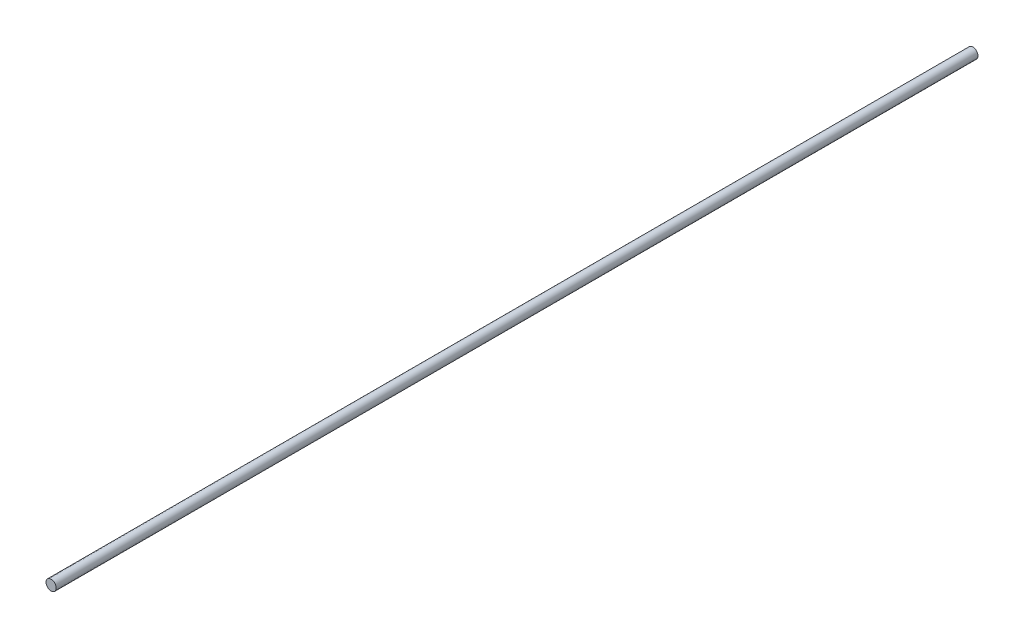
from build123d import *

# Parameters (mm, degrees)
SKETCH1_R           = 30
BOSS_EXTRUDE1_DEPTH = 5400


with BuildPart() as part:
    # Sketch1 → Boss-Extrude1 (new body)
    with BuildSketch(Plane.XY):
        Circle(SKETCH1_R)
    extrude(amount=-BOSS_EXTRUDE1_DEPTH)


solid = part.part
